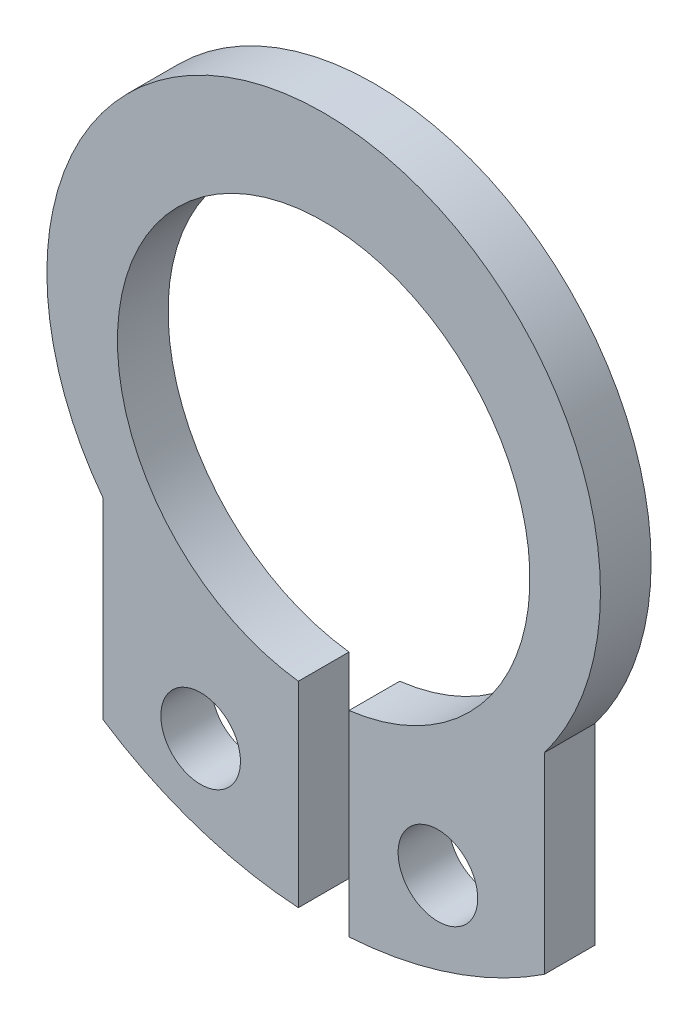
ISO-10303-21;
HEADER;
FILE_DESCRIPTION(('STEP AP214'),'2;1');
FILE_NAME('part.step','',(''),(''),'','','');
FILE_SCHEMA(('AUTOMOTIVE_DESIGN { 1 0 10303 214 1 1 1 1 }'));
ENDSEC;
DATA;
#1=APPLICATION_CONTEXT('core data for automotive mechanical design processes');
#2=APPLICATION_PROTOCOL_DEFINITION('international standard','automotive_design',2000,#1);
#3=PRODUCT_CONTEXT('',#1,'mechanical');
#4=PRODUCT('Part','Part','',(#3));
#5=PRODUCT_RELATED_PRODUCT_CATEGORY('part','',(#4));
#6=PRODUCT_DEFINITION_FORMATION('','',#4);
#7=PRODUCT_DEFINITION_CONTEXT('part definition',#1,'design');
#8=PRODUCT_DEFINITION('design','',#6,#7);
#9=PRODUCT_DEFINITION_SHAPE('','',#8);
#10=(LENGTH_UNIT() NAMED_UNIT(*) SI_UNIT(.MILLI.,.METRE.));
#11=(NAMED_UNIT(*) PLANE_ANGLE_UNIT() SI_UNIT($,.RADIAN.));
#12=(NAMED_UNIT(*) SI_UNIT($,.STERADIAN.) SOLID_ANGLE_UNIT());
#13=UNCERTAINTY_MEASURE_WITH_UNIT(LENGTH_MEASURE(1.E-05),#10,'distance_accuracy_value','');
#14=(GEOMETRIC_REPRESENTATION_CONTEXT(3) GLOBAL_UNCERTAINTY_ASSIGNED_CONTEXT((#13)) GLOBAL_UNIT_ASSIGNED_CONTEXT((#10,
#11,#12)) REPRESENTATION_CONTEXT('',''));
#15=CARTESIAN_POINT('',(0.,0.,0.));
#16=DIRECTION('',(0.,0.,1.));
#17=DIRECTION('',(1.,0.,0.));
#18=AXIS2_PLACEMENT_3D('',#15,#16,#17);
#19=CARTESIAN_POINT('',(-0.17972972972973,-2.84432720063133,0.7));
#20=DIRECTION('',(-1.,0.,0.));
#21=DIRECTION('',(0.,0.,1.));
#22=AXIS2_PLACEMENT_3D('',#19,#20,#21);
#23=PLANE('',#22);
#24=DIRECTION('',(0.,1.,0.));
#25=VECTOR('',#24,1.);
#26=CARTESIAN_POINT('',(-0.17972972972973,-2.84432720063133,0.));
#27=LINE('',#26,#25);
#28=CARTESIAN_POINT('',(-0.179729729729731,-2.84432720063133,0.));
#29=VERTEX_POINT('',#28);
#30=CARTESIAN_POINT('',(-0.179729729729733,-0.133801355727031,0.));
#31=VERTEX_POINT('',#30);
#32=EDGE_CURVE('E98',#29,#31,#27,.T.);
#33=ORIENTED_EDGE('',*,*,#32,.T.);
#34=DIRECTION('',(0.,0.,-1.));
#35=VECTOR('',#34,1.);
#36=CARTESIAN_POINT('',(-0.179729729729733,-0.133801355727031,0.7));
#37=LINE('',#36,#35);
#38=CARTESIAN_POINT('',(-0.179729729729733,-0.133801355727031,0.7));
#39=VERTEX_POINT('',#38);
#40=EDGE_CURVE('E11',#39,#31,#37,.T.);
#41=ORIENTED_EDGE('',*,*,#40,.F.);
#42=DIRECTION('',(0.,1.,0.));
#43=VECTOR('',#42,1.);
#44=CARTESIAN_POINT('',(-0.17972972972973,-2.84432720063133,0.7));
#45=LINE('',#44,#43);
#46=CARTESIAN_POINT('',(-0.179729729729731,-2.84432720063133,0.7));
#47=VERTEX_POINT('',#46);
#48=EDGE_CURVE('E118',#47,#39,#45,.T.);
#49=ORIENTED_EDGE('',*,*,#48,.F.);
#50=DIRECTION('',(0.,0.,-1.));
#51=VECTOR('',#50,1.);
#52=CARTESIAN_POINT('',(-0.179729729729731,-2.84432720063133,0.7));
#53=LINE('',#52,#51);
#54=EDGE_CURVE('E133',#47,#29,#53,.T.);
#55=ORIENTED_EDGE('',*,*,#54,.T.);
#56=EDGE_LOOP('',(#33,#41,#49,#55));
#57=FACE_BOUND('',#56,.T.);
#58=ADVANCED_FACE('F17',(#57),#23,.F.);
#59=CARTESIAN_POINT('',(0.170270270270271,2.69462576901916,0.7));
#60=DIRECTION('',(0.,0.,-1.));
#61=DIRECTION('',(-1.,0.,0.));
#62=AXIS2_PLACEMENT_3D('',#59,#60,#61);
#63=CYLINDRICAL_SURFACE('',#62,2.85);
#64=CARTESIAN_POINT('',(0.170270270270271,2.69462576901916,0.));
#65=DIRECTION('',(0.,0.,1.));
#66=DIRECTION('',(0.,1.,0.));
#67=AXIS2_PLACEMENT_3D('',#64,#65,#66);
#68=CIRCLE('',#67,2.85);
#69=CARTESIAN_POINT('',(0.520270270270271,-0.133801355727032,0.));
#70=VERTEX_POINT('',#69);
#71=EDGE_CURVE('E92',#70,#31,#68,.T.);
#72=ORIENTED_EDGE('',*,*,#71,.F.);
#73=DIRECTION('',(0.,0.,-1.));
#74=VECTOR('',#73,1.);
#75=CARTESIAN_POINT('',(0.520270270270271,-0.133801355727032,0.7));
#76=LINE('',#75,#74);
#77=CARTESIAN_POINT('',(0.520270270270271,-0.133801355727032,0.7));
#78=VERTEX_POINT('',#77);
#79=EDGE_CURVE('E20',#78,#70,#76,.T.);
#80=ORIENTED_EDGE('',*,*,#79,.F.);
#81=CARTESIAN_POINT('',(0.170270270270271,2.69462576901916,0.7));
#82=DIRECTION('',(0.,0.,1.));
#83=DIRECTION('',(0.,1.,0.));
#84=AXIS2_PLACEMENT_3D('',#81,#82,#83);
#85=CIRCLE('',#84,2.85);
#86=EDGE_CURVE('E121',#78,#39,#85,.T.);
#87=ORIENTED_EDGE('',*,*,#86,.T.);
#88=ORIENTED_EDGE('',*,*,#40,.T.);
#89=EDGE_LOOP('',(#72,#80,#87,#88));
#90=FACE_BOUND('',#89,.T.);
#91=ADVANCED_FACE('F93',(#90),#63,.F.);
#92=CARTESIAN_POINT('',(0.520270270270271,-2.84432720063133,0.7));
#93=DIRECTION('',(-1.,0.,0.));
#94=DIRECTION('',(0.,-1.,0.));
#95=AXIS2_PLACEMENT_3D('',#92,#93,#94);
#96=PLANE('',#95);
#97=DIRECTION('',(0.,1.,0.));
#98=VECTOR('',#97,1.);
#99=CARTESIAN_POINT('',(0.520270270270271,-2.84432720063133,0.));
#100=LINE('',#99,#98);
#101=CARTESIAN_POINT('',(0.520270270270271,-2.84432720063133,0.));
#102=VERTEX_POINT('',#101);
#103=EDGE_CURVE('E84',#102,#70,#100,.T.);
#104=ORIENTED_EDGE('',*,*,#103,.F.);
#105=DIRECTION('',(0.,0.,-1.));
#106=VECTOR('',#105,1.);
#107=CARTESIAN_POINT('',(0.520270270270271,-2.84432720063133,0.7));
#108=LINE('',#107,#106);
#109=CARTESIAN_POINT('',(0.520270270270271,-2.84432720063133,0.7));
#110=VERTEX_POINT('',#109);
#111=EDGE_CURVE('E90',#110,#102,#108,.T.);
#112=ORIENTED_EDGE('',*,*,#111,.F.);
#113=DIRECTION('',(0.,1.,0.));
#114=VECTOR('',#113,1.);
#115=CARTESIAN_POINT('',(0.520270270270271,-2.84432720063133,0.7));
#116=LINE('',#115,#114);
#117=EDGE_CURVE('E86',#110,#78,#116,.T.);
#118=ORIENTED_EDGE('',*,*,#117,.T.);
#119=ORIENTED_EDGE('',*,*,#79,.T.);
#120=EDGE_LOOP('',(#104,#112,#118,#119));
#121=FACE_BOUND('',#120,.T.);
#122=ADVANCED_FACE('F82',(#121),#96,.T.);
#123=CARTESIAN_POINT('',(0.170270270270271,2.69462576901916,0.7));
#124=DIRECTION('',(0.,0.,-1.));
#125=DIRECTION('',(-1.,0.,0.));
#126=AXIS2_PLACEMENT_3D('',#123,#124,#125);
#127=CYLINDRICAL_SURFACE('',#126,5.55);
#128=CARTESIAN_POINT('',(0.170270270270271,2.69462576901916,0.));
#129=DIRECTION('',(0.,0.,1.));
#130=DIRECTION('',(0.,1.,0.));
#131=AXIS2_PLACEMENT_3D('',#128,#129,#130);
#132=CIRCLE('',#131,5.55);
#133=CARTESIAN_POINT('',(3.22027027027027,-1.9421834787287,0.));
#134=VERTEX_POINT('',#133);
#135=EDGE_CURVE('E103',#102,#134,#132,.T.);
#136=ORIENTED_EDGE('',*,*,#135,.T.);
#137=DIRECTION('',(0.,0.,-1.));
#138=VECTOR('',#137,1.);
#139=CARTESIAN_POINT('',(3.22027027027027,-1.9421834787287,0.7));
#140=LINE('',#139,#138);
#141=CARTESIAN_POINT('',(3.22027027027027,-1.9421834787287,0.7));
#142=VERTEX_POINT('',#141);
#143=EDGE_CURVE('E143',#142,#134,#140,.T.);
#144=ORIENTED_EDGE('',*,*,#143,.F.);
#145=CARTESIAN_POINT('',(0.170270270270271,2.69462576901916,0.7));
#146=DIRECTION('',(0.,0.,1.));
#147=DIRECTION('',(0.,1.,0.));
#148=AXIS2_PLACEMENT_3D('',#145,#146,#147);
#149=CIRCLE('',#148,5.55);
#150=EDGE_CURVE('E124',#110,#142,#149,.T.);
#151=ORIENTED_EDGE('',*,*,#150,.F.);
#152=ORIENTED_EDGE('',*,*,#111,.T.);
#153=EDGE_LOOP('',(#136,#144,#151,#152));
#154=FACE_BOUND('',#153,.T.);
#155=ADVANCED_FACE('F148',(#154),#127,.T.);
#156=CARTESIAN_POINT('',(3.22027027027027,-1.94218347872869,0.7));
#157=DIRECTION('',(-1.,0.,0.));
#158=DIRECTION('',(0.,0.,1.));
#159=AXIS2_PLACEMENT_3D('',#156,#157,#158);
#160=PLANE('',#159);
#161=DIRECTION('',(0.,1.,0.));
#162=VECTOR('',#161,1.);
#163=CARTESIAN_POINT('',(3.22027027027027,-1.94218347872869,0.));
#164=LINE('',#163,#162);
#165=CARTESIAN_POINT('',(3.22027027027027,0.711352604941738,0.));
#166=VERTEX_POINT('',#165);
#167=EDGE_CURVE('E105',#134,#166,#164,.T.);
#168=ORIENTED_EDGE('',*,*,#167,.T.);
#169=DIRECTION('',(0.,0.,-1.));
#170=VECTOR('',#169,1.);
#171=CARTESIAN_POINT('',(3.22027027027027,0.711352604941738,0.7));
#172=LINE('',#171,#170);
#173=CARTESIAN_POINT('',(3.22027027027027,0.711352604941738,0.7));
#174=VERTEX_POINT('',#173);
#175=EDGE_CURVE('E140',#174,#166,#172,.T.);
#176=ORIENTED_EDGE('',*,*,#175,.F.);
#177=DIRECTION('',(0.,1.,0.));
#178=VECTOR('',#177,1.);
#179=CARTESIAN_POINT('',(3.22027027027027,-1.94218347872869,0.7));
#180=LINE('',#179,#178);
#181=EDGE_CURVE('E126',#142,#174,#180,.T.);
#182=ORIENTED_EDGE('',*,*,#181,.F.);
#183=ORIENTED_EDGE('',*,*,#143,.T.);
#184=EDGE_LOOP('',(#168,#176,#182,#183));
#185=FACE_BOUND('',#184,.T.);
#186=ADVANCED_FACE('F164',(#185),#160,.F.);
#187=CARTESIAN_POINT('',(0.170270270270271,3.01962576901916,0.7));
#188=DIRECTION('',(0.,0.,-1.));
#189=DIRECTION('',(-1.,0.,0.));
#190=AXIS2_PLACEMENT_3D('',#187,#188,#189);
#191=CYLINDRICAL_SURFACE('',#190,3.825);
#192=CARTESIAN_POINT('',(0.170270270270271,3.01962576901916,0.));
#193=DIRECTION('',(0.,0.,1.));
#194=DIRECTION('',(0.,1.,0.));
#195=AXIS2_PLACEMENT_3D('',#192,#193,#194);
#196=CIRCLE('',#195,3.825);
#197=CARTESIAN_POINT('',(-2.87972972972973,0.711352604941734,0.));
#198=VERTEX_POINT('',#197);
#199=EDGE_CURVE('E110',#166,#198,#196,.T.);
#200=ORIENTED_EDGE('',*,*,#199,.T.);
#201=DIRECTION('',(0.,0.,-1.));
#202=VECTOR('',#201,1.);
#203=CARTESIAN_POINT('',(-2.87972972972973,0.711352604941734,0.7));
#204=LINE('',#203,#202);
#205=CARTESIAN_POINT('',(-2.87972972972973,0.711352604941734,0.7));
#206=VERTEX_POINT('',#205);
#207=EDGE_CURVE('E138',#206,#198,#204,.T.);
#208=ORIENTED_EDGE('',*,*,#207,.F.);
#209=CARTESIAN_POINT('',(0.170270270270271,3.01962576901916,0.7));
#210=DIRECTION('',(0.,0.,1.));
#211=DIRECTION('',(0.,1.,0.));
#212=AXIS2_PLACEMENT_3D('',#209,#210,#211);
#213=CIRCLE('',#212,3.825);
#214=EDGE_CURVE('E128',#174,#206,#213,.T.);
#215=ORIENTED_EDGE('',*,*,#214,.F.);
#216=ORIENTED_EDGE('',*,*,#175,.T.);
#217=EDGE_LOOP('',(#200,#208,#215,#216));
#218=FACE_BOUND('',#217,.T.);
#219=ADVANCED_FACE('F161',(#218),#191,.T.);
#220=CARTESIAN_POINT('',(-2.87972972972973,-1.9421834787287,0.7));
#221=DIRECTION('',(-1.,0.,0.));
#222=DIRECTION('',(0.,0.,1.));
#223=AXIS2_PLACEMENT_3D('',#220,#221,#222);
#224=PLANE('',#223);
#225=DIRECTION('',(0.,1.,0.));
#226=VECTOR('',#225,1.);
#227=CARTESIAN_POINT('',(-2.87972972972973,-1.9421834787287,0.));
#228=LINE('',#227,#226);
#229=CARTESIAN_POINT('',(-2.87972972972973,-1.9421834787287,0.));
#230=VERTEX_POINT('',#229);
#231=EDGE_CURVE('E113',#230,#198,#228,.T.);
#232=ORIENTED_EDGE('',*,*,#231,.F.);
#233=DIRECTION('',(0.,0.,-1.));
#234=VECTOR('',#233,1.);
#235=CARTESIAN_POINT('',(-2.87972972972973,-1.9421834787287,0.7));
#236=LINE('',#235,#234);
#237=CARTESIAN_POINT('',(-2.87972972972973,-1.9421834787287,0.7));
#238=VERTEX_POINT('',#237);
#239=EDGE_CURVE('E39',#238,#230,#236,.T.);
#240=ORIENTED_EDGE('',*,*,#239,.F.);
#241=DIRECTION('',(0.,1.,0.));
#242=VECTOR('',#241,1.);
#243=CARTESIAN_POINT('',(-2.87972972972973,-1.9421834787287,0.7));
#244=LINE('',#243,#242);
#245=EDGE_CURVE('E130',#238,#206,#244,.T.);
#246=ORIENTED_EDGE('',*,*,#245,.T.);
#247=ORIENTED_EDGE('',*,*,#207,.T.);
#248=EDGE_LOOP('',(#232,#240,#246,#247));
#249=FACE_BOUND('',#248,.T.);
#250=ADVANCED_FACE('F157',(#249),#224,.T.);
#251=CARTESIAN_POINT('',(0.170270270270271,2.69462576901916,0.7));
#252=DIRECTION('',(0.,0.,-1.));
#253=DIRECTION('',(-1.,0.,0.));
#254=AXIS2_PLACEMENT_3D('',#251,#252,#253);
#255=CYLINDRICAL_SURFACE('',#254,5.55);
#256=CARTESIAN_POINT('',(0.170270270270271,2.69462576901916,0.));
#257=DIRECTION('',(0.,0.,1.));
#258=DIRECTION('',(0.,1.,0.));
#259=AXIS2_PLACEMENT_3D('',#256,#257,#258);
#260=CIRCLE('',#259,5.55);
#261=EDGE_CURVE('E116',#230,#29,#260,.T.);
#262=ORIENTED_EDGE('',*,*,#261,.T.);
#263=ORIENTED_EDGE('',*,*,#54,.F.);
#264=CARTESIAN_POINT('',(0.170270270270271,2.69462576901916,0.7));
#265=DIRECTION('',(0.,0.,1.));
#266=DIRECTION('',(0.,1.,0.));
#267=AXIS2_PLACEMENT_3D('',#264,#265,#266);
#268=CIRCLE('',#267,5.55);
#269=EDGE_CURVE('E31',#238,#47,#268,.T.);
#270=ORIENTED_EDGE('',*,*,#269,.F.);
#271=ORIENTED_EDGE('',*,*,#239,.T.);
#272=EDGE_LOOP('',(#262,#263,#270,#271));
#273=FACE_BOUND('',#272,.T.);
#274=ADVANCED_FACE('F209',(#273),#255,.T.);
#275=CARTESIAN_POINT('',(0.170270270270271,2.69462576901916,0.7));
#276=DIRECTION('',(0.,0.,1.));
#277=DIRECTION('',(1.,0.,0.));
#278=AXIS2_PLACEMENT_3D('',#275,#276,#277);
#279=PLANE('',#278);
#280=CARTESIAN_POINT('',(1.7488416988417,-1.49432720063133,0.7));
#281=DIRECTION('',(0.,0.,-1.));
#282=DIRECTION('',(0.,1.,0.));
#283=AXIS2_PLACEMENT_3D('',#280,#281,#282);
#284=CIRCLE('',#283,0.55);
#285=CARTESIAN_POINT('',(1.7488416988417,-0.944327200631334,0.7));
#286=VERTEX_POINT('',#285);
#287=EDGE_CURVE('E251',#286,#286,#284,.T.);
#288=ORIENTED_EDGE('',*,*,#287,.T.);
#289=EDGE_LOOP('',(#288));
#290=FACE_BOUND('',#289,.T.);
#291=CARTESIAN_POINT('',(-1.52972972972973,-1.49432720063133,0.7));
#292=DIRECTION('',(0.,0.,-1.));
#293=DIRECTION('',(0.,1.,0.));
#294=AXIS2_PLACEMENT_3D('',#291,#292,#293);
#295=CIRCLE('',#294,0.55);
#296=CARTESIAN_POINT('',(-1.52972972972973,-0.944327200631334,0.7));
#297=VERTEX_POINT('',#296);
#298=EDGE_CURVE('E120',#297,#297,#295,.T.);
#299=ORIENTED_EDGE('',*,*,#298,.T.);
#300=EDGE_LOOP('',(#299));
#301=FACE_BOUND('',#300,.T.);
#302=ORIENTED_EDGE('',*,*,#48,.T.);
#303=ORIENTED_EDGE('',*,*,#86,.F.);
#304=ORIENTED_EDGE('',*,*,#117,.F.);
#305=ORIENTED_EDGE('',*,*,#150,.T.);
#306=ORIENTED_EDGE('',*,*,#181,.T.);
#307=ORIENTED_EDGE('',*,*,#214,.T.);
#308=ORIENTED_EDGE('',*,*,#245,.F.);
#309=ORIENTED_EDGE('',*,*,#269,.T.);
#310=EDGE_LOOP('',(#302,#303,#304,#305,#306,#307,#308,#309));
#311=FACE_BOUND('',#310,.T.);
#312=ADVANCED_FACE('F151',(#290,#301,#311),#279,.T.);
#313=CARTESIAN_POINT('',(0.170270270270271,2.69462576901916,0.));
#314=DIRECTION('',(0.,0.,1.));
#315=DIRECTION('',(1.,0.,0.));
#316=AXIS2_PLACEMENT_3D('',#313,#314,#315);
#317=PLANE('',#316);
#318=CARTESIAN_POINT('',(1.7488416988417,-1.49432720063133,0.));
#319=DIRECTION('',(0.,0.,1.));
#320=DIRECTION('',(0.,1.,0.));
#321=AXIS2_PLACEMENT_3D('',#318,#319,#320);
#322=CIRCLE('',#321,0.55);
#323=CARTESIAN_POINT('',(1.7488416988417,-0.944327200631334,0.));
#324=VERTEX_POINT('',#323);
#325=EDGE_CURVE('E254',#324,#324,#322,.T.);
#326=ORIENTED_EDGE('',*,*,#325,.T.);
#327=EDGE_LOOP('',(#326));
#328=FACE_BOUND('',#327,.T.);
#329=CARTESIAN_POINT('',(-1.52972972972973,-1.49432720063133,0.));
#330=DIRECTION('',(0.,0.,1.));
#331=DIRECTION('',(0.,1.,0.));
#332=AXIS2_PLACEMENT_3D('',#329,#330,#331);
#333=CIRCLE('',#332,0.55);
#334=CARTESIAN_POINT('',(-1.52972972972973,-0.944327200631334,0.));
#335=VERTEX_POINT('',#334);
#336=EDGE_CURVE('E256',#335,#335,#333,.T.);
#337=ORIENTED_EDGE('',*,*,#336,.T.);
#338=EDGE_LOOP('',(#337));
#339=FACE_BOUND('',#338,.T.);
#340=ORIENTED_EDGE('',*,*,#32,.F.);
#341=ORIENTED_EDGE('',*,*,#261,.F.);
#342=ORIENTED_EDGE('',*,*,#231,.T.);
#343=ORIENTED_EDGE('',*,*,#199,.F.);
#344=ORIENTED_EDGE('',*,*,#167,.F.);
#345=ORIENTED_EDGE('',*,*,#135,.F.);
#346=ORIENTED_EDGE('',*,*,#103,.T.);
#347=ORIENTED_EDGE('',*,*,#71,.T.);
#348=EDGE_LOOP('',(#340,#341,#342,#343,#344,#345,#346,#347));
#349=FACE_BOUND('',#348,.T.);
#350=ADVANCED_FACE('F101',(#328,#339,#349),#317,.F.);
#351=CARTESIAN_POINT('',(-1.52972972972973,-1.49432720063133,0.));
#352=DIRECTION('',(0.,0.,1.));
#353=DIRECTION('',(0.,1.,0.));
#354=AXIS2_PLACEMENT_3D('',#351,#352,#353);
#355=CYLINDRICAL_SURFACE('',#354,0.55);
#356=ORIENTED_EDGE('',*,*,#298,.F.);
#357=EDGE_LOOP('',(#356));
#358=FACE_BOUND('',#357,.T.);
#359=ORIENTED_EDGE('',*,*,#336,.F.);
#360=EDGE_LOOP('',(#359));
#361=FACE_BOUND('',#360,.T.);
#362=ADVANCED_FACE('F229',(#358,#361),#355,.F.);
#363=CARTESIAN_POINT('',(1.7488416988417,-1.49432720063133,0.));
#364=DIRECTION('',(0.,0.,1.));
#365=DIRECTION('',(0.,1.,0.));
#366=AXIS2_PLACEMENT_3D('',#363,#364,#365);
#367=CYLINDRICAL_SURFACE('',#366,0.55);
#368=ORIENTED_EDGE('',*,*,#287,.F.);
#369=EDGE_LOOP('',(#368));
#370=FACE_BOUND('',#369,.T.);
#371=ORIENTED_EDGE('',*,*,#325,.F.);
#372=EDGE_LOOP('',(#371));
#373=FACE_BOUND('',#372,.T.);
#374=ADVANCED_FACE('F237',(#370,#373),#367,.F.);
#375=CLOSED_SHELL('',(#58,#91,#122,#155,#186,#219,#250,#274,#312,#350,#362,#374));
#376=MANIFOLD_SOLID_BREP('B1',#375);
#377=ADVANCED_BREP_SHAPE_REPRESENTATION('',(#18,#376),#14);
#378=SHAPE_DEFINITION_REPRESENTATION(#9,#377);
ENDSEC;
END-ISO-10303-21;
